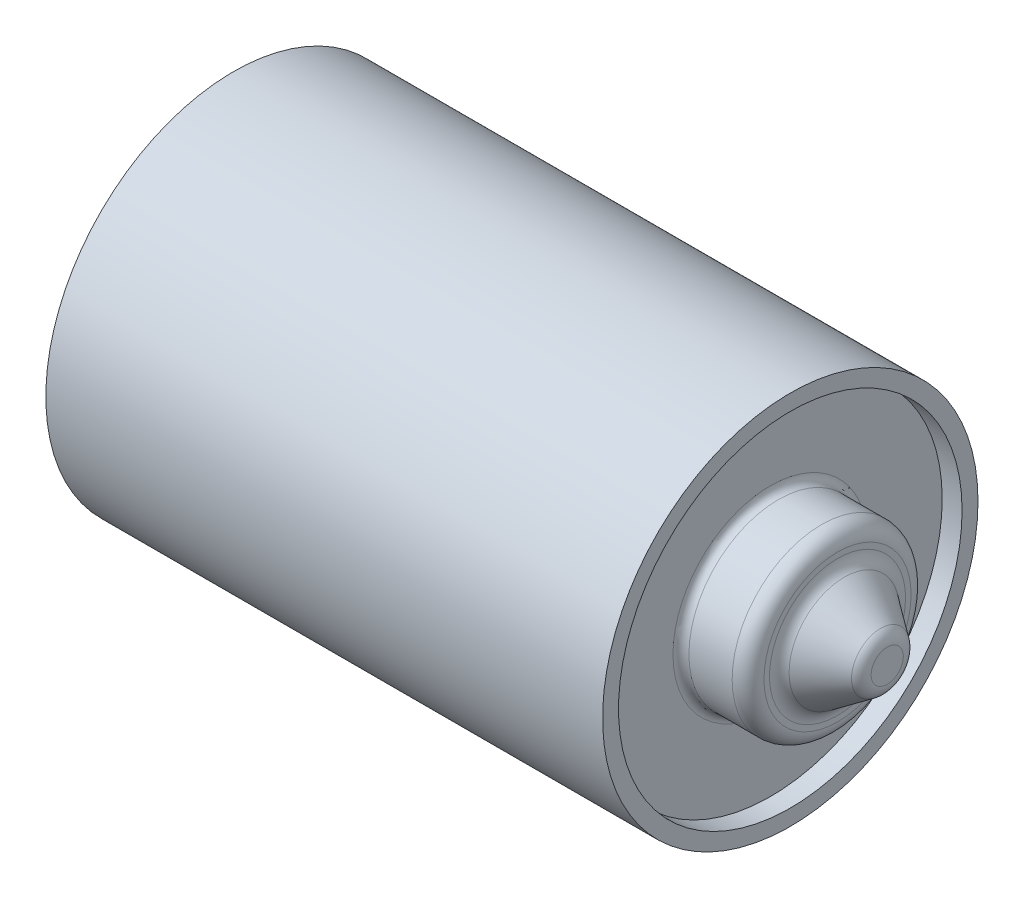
ISO-10303-21;
HEADER;
FILE_DESCRIPTION(('STEP AP214'),'2;1');
FILE_NAME('part.step','',(''),(''),'','','');
FILE_SCHEMA(('AUTOMOTIVE_DESIGN { 1 0 10303 214 1 1 1 1 }'));
ENDSEC;
DATA;
#1=APPLICATION_CONTEXT('core data for automotive mechanical design processes');
#2=APPLICATION_PROTOCOL_DEFINITION('international standard','automotive_design',2000,#1);
#3=PRODUCT_CONTEXT('',#1,'mechanical');
#4=PRODUCT('Part','Part','',(#3));
#5=PRODUCT_RELATED_PRODUCT_CATEGORY('part','',(#4));
#6=PRODUCT_DEFINITION_FORMATION('','',#4);
#7=PRODUCT_DEFINITION_CONTEXT('part definition',#1,'design');
#8=PRODUCT_DEFINITION('design','',#6,#7);
#9=PRODUCT_DEFINITION_SHAPE('','',#8);
#10=(LENGTH_UNIT() NAMED_UNIT(*) SI_UNIT(.MILLI.,.METRE.));
#11=(NAMED_UNIT(*) PLANE_ANGLE_UNIT() SI_UNIT($,.RADIAN.));
#12=(NAMED_UNIT(*) SI_UNIT($,.STERADIAN.) SOLID_ANGLE_UNIT());
#13=UNCERTAINTY_MEASURE_WITH_UNIT(LENGTH_MEASURE(1.E-05),#10,'distance_accuracy_value','');
#14=(GEOMETRIC_REPRESENTATION_CONTEXT(3) GLOBAL_UNCERTAINTY_ASSIGNED_CONTEXT((#13)) GLOBAL_UNIT_ASSIGNED_CONTEXT((#10,
#11,#12)) REPRESENTATION_CONTEXT('',''));
#15=CARTESIAN_POINT('',(0.,0.,0.));
#16=DIRECTION('',(0.,0.,1.));
#17=DIRECTION('',(1.,0.,0.));
#18=AXIS2_PLACEMENT_3D('',#15,#16,#17);
#19=CARTESIAN_POINT('',(774.926761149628,58.1044475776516,38.1099480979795));
#20=DIRECTION('',(1.,0.,0.));
#21=DIRECTION('',(0.,0.,-1.));
#22=AXIS2_PLACEMENT_3D('',#19,#20,#21);
#23=PLANE('',#22);
#24=CARTESIAN_POINT('',(774.926761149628,56.8205450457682,38.1099480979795));
#25=DIRECTION('',(-1.,0.,0.));
#26=DIRECTION('',(0.,0.,-1.));
#27=AXIS2_PLACEMENT_3D('',#24,#25,#26);
#28=CIRCLE('',#27,2.56780506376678);
#29=CARTESIAN_POINT('',(774.926761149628,56.8205450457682,35.5421430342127));
#30=VERTEX_POINT('',#29);
#31=CARTESIAN_POINT('',(774.926761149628,56.8205450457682,40.6777531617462));
#32=VERTEX_POINT('',#31);
#33=EDGE_CURVE('E68',#30,#32,#28,.T.);
#34=ORIENTED_EDGE('',*,*,#33,.F.);
#35=CARTESIAN_POINT('',(774.926761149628,56.8205450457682,38.1099480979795));
#36=DIRECTION('',(-1.,0.,0.));
#37=DIRECTION('',(0.,1.,0.));
#38=AXIS2_PLACEMENT_3D('',#35,#36,#37);
#39=CIRCLE('',#38,2.5678050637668);
#40=CARTESIAN_POINT('',(774.926761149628,59.388350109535,38.1099480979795));
#41=VERTEX_POINT('',#40);
#42=EDGE_CURVE('E72',#41,#30,#39,.T.);
#43=ORIENTED_EDGE('',*,*,#42,.F.);
#44=CARTESIAN_POINT('',(774.926761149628,56.8205450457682,38.1099480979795));
#45=DIRECTION('',(-1.,0.,0.));
#46=DIRECTION('',(0.,0.,1.));
#47=AXIS2_PLACEMENT_3D('',#44,#45,#46);
#48=CIRCLE('',#47,2.56780506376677);
#49=EDGE_CURVE('E74',#32,#41,#48,.T.);
#50=ORIENTED_EDGE('',*,*,#49,.F.);
#51=EDGE_LOOP('',(#34,#43,#50));
#52=FACE_BOUND('',#51,.T.);
#53=ADVANCED_FACE('F16',(#52),#23,.T.);
#54=CARTESIAN_POINT('',(772.386761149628,56.8205450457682,38.1099480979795));
#55=DIRECTION('',(1.,0.,0.));
#56=DIRECTION('',(0.,0.,-1.));
#57=AXIS2_PLACEMENT_3D('',#54,#55,#56);
#58=TOROIDAL_SURFACE('',#57,2.56780506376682,2.54);
#59=CARTESIAN_POINT('',(773.864951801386,56.8205450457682,38.1099480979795));
#60=DIRECTION('',(-1.,0.,0.));
#61=DIRECTION('',(0.,1.,0.));
#62=AXIS2_PLACEMENT_3D('',#59,#60,#61);
#63=CIRCLE('',#62,4.63336852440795);
#64=CARTESIAN_POINT('',(773.864951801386,61.4539135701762,38.1099480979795));
#65=VERTEX_POINT('',#64);
#66=EDGE_CURVE('E81',#65,#65,#63,.T.);
#67=ORIENTED_EDGE('',*,*,#66,.F.);
#68=EDGE_LOOP('',(#67));
#69=FACE_BOUND('',#68,.T.);
#70=ORIENTED_EDGE('',*,*,#49,.T.);
#71=ORIENTED_EDGE('',*,*,#42,.T.);
#72=ORIENTED_EDGE('',*,*,#33,.T.);
#73=EDGE_LOOP('',(#70,#71,#72));
#74=FACE_BOUND('',#73,.T.);
#75=ADVANCED_FACE('F79',(#69,#74),#58,.T.);
#76=CARTESIAN_POINT('',(768.051070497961,56.8205450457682,38.1099480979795));
#77=DIRECTION('',(-1.,0.,0.));
#78=DIRECTION('',(0.,0.,1.));
#79=AXIS2_PLACEMENT_3D('',#76,#77,#78);
#80=CONICAL_SURFACE('',#79,8.7939886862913,0.621142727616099);
#81=CARTESIAN_POINT('',(768.051070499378,56.8205450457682,38.1099480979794));
#82=DIRECTION('',(-1.,0.,0.));
#83=DIRECTION('',(0.,0.,1.));
#84=AXIS2_PLACEMENT_3D('',#81,#82,#83);
#85=CIRCLE('',#84,8.79398868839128);
#86=CARTESIAN_POINT('',(768.051070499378,56.8205450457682,46.9039367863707));
#87=VERTEX_POINT('',#86);
#88=EDGE_CURVE('E108',#87,#87,#85,.T.);
#89=ORIENTED_EDGE('',*,*,#88,.F.);
#90=EDGE_LOOP('',(#89));
#91=FACE_BOUND('',#90,.T.);
#92=ORIENTED_EDGE('',*,*,#66,.T.);
#93=EDGE_LOOP('',(#92));
#94=FACE_BOUND('',#93,.T.);
#95=ADVANCED_FACE('F99',(#91,#94),#80,.T.);
#96=CARTESIAN_POINT('',(769.529261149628,56.8205450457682,38.1099480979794));
#97=DIRECTION('',(1.,0.,0.));
#98=DIRECTION('',(0.,0.,-1.));
#99=AXIS2_PLACEMENT_3D('',#96,#97,#98);
#100=TOROIDAL_SURFACE('',#99,10.8595521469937,2.53999999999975);
#101=CARTESIAN_POINT('',(766.989261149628,56.8205450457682,38.1099480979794));
#102=DIRECTION('',(1.,0.,0.));
#103=DIRECTION('',(0.,0.,-1.));
#104=AXIS2_PLACEMENT_3D('',#101,#102,#103);
#105=CIRCLE('',#104,10.859552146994);
#106=CARTESIAN_POINT('',(766.989261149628,56.8205450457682,27.2503959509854));
#107=VERTEX_POINT('',#106);
#108=EDGE_CURVE('E121',#107,#107,#105,.F.);
#109=ORIENTED_EDGE('',*,*,#108,.F.);
#110=EDGE_LOOP('',(#109));
#111=FACE_BOUND('',#110,.T.);
#112=ORIENTED_EDGE('',*,*,#88,.T.);
#113=EDGE_LOOP('',(#112));
#114=FACE_BOUND('',#113,.T.);
#115=ADVANCED_FACE('F206',(#111,#114),#100,.F.);
#116=CARTESIAN_POINT('',(766.989261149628,68.1240711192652,38.1099480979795));
#117=DIRECTION('',(1.,0.,0.));
#118=DIRECTION('',(0.,0.,-1.));
#119=AXIS2_PLACEMENT_3D('',#116,#117,#118);
#120=PLANE('',#119);
#121=ORIENTED_EDGE('',*,*,#108,.T.);
#122=EDGE_LOOP('',(#121));
#123=FACE_BOUND('',#122,.T.);
#124=CARTESIAN_POINT('',(766.989261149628,56.8205450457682,38.1099480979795));
#125=DIRECTION('',(-1.,0.,0.));
#126=DIRECTION('',(0.,0.,-1.));
#127=AXIS2_PLACEMENT_3D('',#124,#125,#126);
#128=CIRCLE('',#127,11.7475000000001);
#129=CARTESIAN_POINT('',(766.989261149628,56.8205450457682,26.3624480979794));
#130=VERTEX_POINT('',#129);
#131=CARTESIAN_POINT('',(766.989261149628,56.8205450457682,49.8574480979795));
#132=VERTEX_POINT('',#131);
#133=EDGE_CURVE('E125',#130,#132,#128,.T.);
#134=ORIENTED_EDGE('',*,*,#133,.F.);
#135=CARTESIAN_POINT('',(766.989261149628,56.8205450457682,38.1099480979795));
#136=DIRECTION('',(-1.,0.,0.));
#137=DIRECTION('',(0.,1.,0.));
#138=AXIS2_PLACEMENT_3D('',#135,#136,#137);
#139=CIRCLE('',#138,11.7475000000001);
#140=CARTESIAN_POINT('',(766.989261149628,68.5680450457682,38.1099480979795));
#141=VERTEX_POINT('',#140);
#142=EDGE_CURVE('E52',#141,#130,#139,.T.);
#143=ORIENTED_EDGE('',*,*,#142,.F.);
#144=CARTESIAN_POINT('',(766.989261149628,56.8205450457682,38.1099480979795));
#145=DIRECTION('',(-1.,0.,0.));
#146=DIRECTION('',(0.,0.,1.));
#147=AXIS2_PLACEMENT_3D('',#144,#145,#146);
#148=CIRCLE('',#147,11.7475);
#149=EDGE_CURVE('E129',#132,#141,#148,.T.);
#150=ORIENTED_EDGE('',*,*,#149,.F.);
#151=EDGE_LOOP('',(#134,#143,#150));
#152=FACE_BOUND('',#151,.T.);
#153=ADVANCED_FACE('F149',(#123,#152),#120,.T.);
#154=CARTESIAN_POINT('',(764.449261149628,56.8205450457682,38.1099480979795));
#155=DIRECTION('',(1.,0.,0.));
#156=DIRECTION('',(0.,0.,-1.));
#157=AXIS2_PLACEMENT_3D('',#154,#155,#156);
#158=TOROIDAL_SURFACE('',#157,11.7475,2.54000000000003);
#159=CARTESIAN_POINT('',(764.449261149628,56.8205450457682,38.1099480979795));
#160=DIRECTION('',(1.,0.,0.));
#161=DIRECTION('',(0.,0.,-1.));
#162=AXIS2_PLACEMENT_3D('',#159,#160,#161);
#163=CIRCLE('',#162,14.2875);
#164=CARTESIAN_POINT('',(764.449261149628,56.8205450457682,23.8224480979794));
#165=VERTEX_POINT('',#164);
#166=EDGE_CURVE('E161',#165,#165,#163,.F.);
#167=ORIENTED_EDGE('',*,*,#166,.F.);
#168=EDGE_LOOP('',(#167));
#169=FACE_BOUND('',#168,.T.);
#170=ORIENTED_EDGE('',*,*,#149,.T.);
#171=ORIENTED_EDGE('',*,*,#142,.T.);
#172=ORIENTED_EDGE('',*,*,#133,.T.);
#173=EDGE_LOOP('',(#170,#171,#172));
#174=FACE_BOUND('',#173,.T.);
#175=ADVANCED_FACE('F138',(#169,#174),#158,.T.);
#176=CARTESIAN_POINT('',(760.996131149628,56.8205450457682,38.1099480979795));
#177=DIRECTION('',(1.,0.,0.));
#178=DIRECTION('',(0.,0.,-1.));
#179=AXIS2_PLACEMENT_3D('',#176,#177,#178);
#180=CYLINDRICAL_SURFACE('',#179,14.2875);
#181=CARTESIAN_POINT('',(757.543001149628,56.8205450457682,38.1099480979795));
#182=DIRECTION('',(-1.,0.,0.));
#183=DIRECTION('',(0.,0.,1.));
#184=AXIS2_PLACEMENT_3D('',#181,#182,#183);
#185=CIRCLE('',#184,14.2875);
#186=CARTESIAN_POINT('',(757.543001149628,56.8205450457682,52.3974480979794));
#187=VERTEX_POINT('',#186);
#188=EDGE_CURVE('E159',#187,#187,#185,.T.);
#189=ORIENTED_EDGE('',*,*,#188,.F.);
#190=EDGE_LOOP('',(#189));
#191=FACE_BOUND('',#190,.T.);
#192=ORIENTED_EDGE('',*,*,#166,.T.);
#193=EDGE_LOOP('',(#192));
#194=FACE_BOUND('',#193,.T.);
#195=ADVANCED_FACE('F148',(#191,#194),#180,.T.);
#196=CARTESIAN_POINT('',(757.543001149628,56.8205450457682,38.1099480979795));
#197=DIRECTION('',(1.,0.,0.));
#198=DIRECTION('',(0.,0.,-1.));
#199=AXIS2_PLACEMENT_3D('',#196,#197,#198);
#200=TOROIDAL_SURFACE('',#199,15.5575000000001,1.27000000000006);
#201=CARTESIAN_POINT('',(756.273001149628,56.8205450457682,53.6674480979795));
#202=CARTESIAN_POINT('',(756.273001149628,58.2481641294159,53.6673507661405));
#203=CARTESIAN_POINT('',(756.273001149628,59.6514352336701,53.4077213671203));
#204=CARTESIAN_POINT('',(756.273001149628,61.1393053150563,53.132439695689));
#205=CARTESIAN_POINT('',(756.273001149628,62.5471784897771,52.5751295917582));
#206=CARTESIAN_POINT('',(756.273001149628,64.013177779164,51.9948101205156));
#207=CARTESIAN_POINT('',(756.273001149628,65.3337607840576,51.1315057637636));
#208=CARTESIAN_POINT('',(756.273001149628,66.6817690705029,50.2502726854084));
#209=CARTESIAN_POINT('',(756.273001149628,67.8213587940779,49.1107618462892));
#210=CARTESIAN_POINT('',(756.273001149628,68.9601910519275,47.9720084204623));
#211=CARTESIAN_POINT('',(756.273001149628,69.8421027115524,46.6231638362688));
#212=CARTESIAN_POINT('',(756.273001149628,70.7049234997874,45.3035178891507));
#213=CARTESIAN_POINT('',(756.273001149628,71.285726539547,43.8365815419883));
#214=CARTESIAN_POINT('',(756.273001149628,71.8427452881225,42.429717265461));
#215=CARTESIAN_POINT('',(756.273001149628,72.1183183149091,40.9408382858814));
#216=CARTESIAN_POINT('',(756.273001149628,72.3779476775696,39.5381004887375));
#217=CARTESIAN_POINT('',(756.273001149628,72.3780450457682,38.1099480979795));
#218=B_SPLINE_CURVE_WITH_KNOTS('',2,(#201,#202,#203,#204,#205,#206,#207,#208,#209,#210,#211,
#212,#213,#214,#215,#216,#217),.UNSPECIFIED.,.F.,.F.,(3,2,2,2,2,2,2,2,3),(0.,0.125,0.25,0.375,
0.5,0.625,0.75,0.875,1.),.UNSPECIFIED.);
#219=CARTESIAN_POINT('',(756.273001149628,56.8205450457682,53.6674480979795));
#220=VERTEX_POINT('',#219);
#221=CARTESIAN_POINT('',(756.273001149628,72.3780450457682,38.1099480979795));
#222=VERTEX_POINT('',#221);
#223=EDGE_CURVE('E44',#220,#222,#218,.T.);
#224=ORIENTED_EDGE('',*,*,#223,.F.);
#225=CARTESIAN_POINT('',(756.273001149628,56.8205450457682,38.1099480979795));
#226=DIRECTION('',(1.,0.,0.));
#227=DIRECTION('',(0.,0.,-1.));
#228=AXIS2_PLACEMENT_3D('',#225,#226,#227);
#229=CIRCLE('',#228,15.5575);
#230=CARTESIAN_POINT('',(756.273001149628,56.8205450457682,22.5524480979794));
#231=VERTEX_POINT('',#230);
#232=EDGE_CURVE('E36',#231,#220,#229,.F.);
#233=ORIENTED_EDGE('',*,*,#232,.F.);
#234=CARTESIAN_POINT('',(756.273001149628,72.3780450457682,38.1099480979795));
#235=CARTESIAN_POINT('',(756.273001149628,72.3779477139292,36.6823290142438));
#236=CARTESIAN_POINT('',(756.273001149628,72.1183183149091,35.2790579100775));
#237=CARTESIAN_POINT('',(756.273001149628,71.8430366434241,33.7911878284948));
#238=CARTESIAN_POINT('',(756.273001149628,71.285726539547,32.3833146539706));
#239=CARTESIAN_POINT('',(756.273001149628,70.7054070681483,30.9173153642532));
#240=CARTESIAN_POINT('',(756.273001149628,69.8421027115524,29.5967323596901));
#241=CARTESIAN_POINT('',(756.273001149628,68.9608696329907,28.2487240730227));
#242=CARTESIAN_POINT('',(756.273001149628,67.8213587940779,27.1091343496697));
#243=CARTESIAN_POINT('',(756.273001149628,66.6826053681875,25.9703020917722));
#244=CARTESIAN_POINT('',(756.273001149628,65.3337607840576,25.0883904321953));
#245=CARTESIAN_POINT('',(756.273001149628,64.0141148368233,24.2255696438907));
#246=CARTESIAN_POINT('',(756.273001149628,62.547178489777,23.6447666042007));
#247=CARTESIAN_POINT('',(756.273001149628,61.1403142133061,23.0877478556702));
#248=CARTESIAN_POINT('',(756.273001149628,59.6514352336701,22.8121748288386));
#249=CARTESIAN_POINT('',(756.273001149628,58.2486974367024,22.5525454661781));
#250=CARTESIAN_POINT('',(756.273001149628,56.8205450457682,22.5524480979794));
#251=B_SPLINE_CURVE_WITH_KNOTS('',2,(#234,#235,#236,#237,#238,#239,#240,#241,#242,#243,#244,
#245,#246,#247,#248,#249,#250),.UNSPECIFIED.,.F.,.F.,(3,2,2,2,2,2,2,2,3),(0.,0.125,0.25,0.375,
0.5,0.625,0.75,0.875,1.),.UNSPECIFIED.);
#252=EDGE_CURVE('E237',#222,#231,#251,.T.);
#253=ORIENTED_EDGE('',*,*,#252,.F.);
#254=EDGE_LOOP('',(#224,#233,#253));
#255=FACE_BOUND('',#254,.T.);
#256=ORIENTED_EDGE('',*,*,#188,.T.);
#257=EDGE_LOOP('',(#256));
#258=FACE_BOUND('',#257,.T.);
#259=ADVANCED_FACE('F18',(#255,#258),#200,.F.);
#260=CARTESIAN_POINT('',(756.273001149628,78.3152950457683,38.1099480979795));
#261=DIRECTION('',(1.,0.,0.));
#262=DIRECTION('',(0.,0.,-1.));
#263=AXIS2_PLACEMENT_3D('',#260,#261,#262);
#264=PLANE('',#263);
#265=ORIENTED_EDGE('',*,*,#252,.T.);
#266=ORIENTED_EDGE('',*,*,#232,.T.);
#267=ORIENTED_EDGE('',*,*,#223,.T.);
#268=EDGE_LOOP('',(#265,#266,#267));
#269=FACE_BOUND('',#268,.T.);
#270=CARTESIAN_POINT('',(756.273001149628,56.8205450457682,38.1099480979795));
#271=DIRECTION('',(1.,0.,0.));
#272=DIRECTION('',(0.,0.,-1.));
#273=AXIS2_PLACEMENT_3D('',#270,#271,#272);
#274=CIRCLE('',#273,27.432);
#275=CARTESIAN_POINT('',(756.273001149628,56.8205450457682,10.6779480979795));
#276=VERTEX_POINT('',#275);
#277=EDGE_CURVE('E338',#276,#276,#274,.T.);
#278=ORIENTED_EDGE('',*,*,#277,.T.);
#279=EDGE_LOOP('',(#278));
#280=FACE_BOUND('',#279,.T.);
#281=ADVANCED_FACE('F231',(#269,#280),#264,.T.);
#282=CARTESIAN_POINT('',(757.860501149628,56.8205450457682,38.1099480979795));
#283=DIRECTION('',(1.,0.,0.));
#284=DIRECTION('',(0.,0.,-1.));
#285=AXIS2_PLACEMENT_3D('',#282,#283,#284);
#286=CYLINDRICAL_SURFACE('',#285,27.432);
#287=ORIENTED_EDGE('',*,*,#277,.F.);
#288=EDGE_LOOP('',(#287));
#289=FACE_BOUND('',#288,.T.);
#290=CARTESIAN_POINT('',(759.448001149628,56.8205450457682,38.1099480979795));
#291=DIRECTION('',(1.,0.,0.));
#292=DIRECTION('',(0.,0.,-1.));
#293=AXIS2_PLACEMENT_3D('',#290,#291,#292);
#294=CIRCLE('',#293,27.432);
#295=CARTESIAN_POINT('',(759.448001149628,56.8205450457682,10.6779480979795));
#296=VERTEX_POINT('',#295);
#297=EDGE_CURVE('E340',#296,#296,#294,.F.);
#298=ORIENTED_EDGE('',*,*,#297,.F.);
#299=EDGE_LOOP('',(#298));
#300=FACE_BOUND('',#299,.T.);
#301=ADVANCED_FACE('F228',(#289,#300),#286,.F.);
#302=CARTESIAN_POINT('',(670.548001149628,71.8065450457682,38.1099480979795));
#303=DIRECTION('',(-1.,0.,0.));
#304=DIRECTION('',(0.,0.,1.));
#305=AXIS2_PLACEMENT_3D('',#302,#303,#304);
#306=PLANE('',#305);
#307=CARTESIAN_POINT('',(670.548001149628,56.8205450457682,38.1099480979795));
#308=DIRECTION('',(1.,0.,0.));
#309=DIRECTION('',(0.,0.,-1.));
#310=AXIS2_PLACEMENT_3D('',#307,#308,#309);
#311=CIRCLE('',#310,29.972);
#312=CARTESIAN_POINT('',(670.548001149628,56.8205450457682,8.13794809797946));
#313=VERTEX_POINT('',#312);
#314=EDGE_CURVE('E28',#313,#313,#311,.T.);
#315=ORIENTED_EDGE('',*,*,#314,.F.);
#316=EDGE_LOOP('',(#315));
#317=FACE_BOUND('',#316,.T.);
#318=ADVANCED_FACE('F220',(#317),#306,.T.);
#319=CARTESIAN_POINT('',(759.448001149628,85.5225450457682,38.1099480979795));
#320=DIRECTION('',(1.,0.,0.));
#321=DIRECTION('',(0.,0.,-1.));
#322=AXIS2_PLACEMENT_3D('',#319,#320,#321);
#323=PLANE('',#322);
#324=ORIENTED_EDGE('',*,*,#297,.T.);
#325=EDGE_LOOP('',(#324));
#326=FACE_BOUND('',#325,.T.);
#327=CARTESIAN_POINT('',(759.448001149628,56.8205450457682,38.1099480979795));
#328=DIRECTION('',(1.,0.,0.));
#329=DIRECTION('',(0.,0.,-1.));
#330=AXIS2_PLACEMENT_3D('',#327,#328,#329);
#331=CIRCLE('',#330,29.972);
#332=CARTESIAN_POINT('',(759.448001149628,56.8205450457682,8.13794809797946));
#333=VERTEX_POINT('',#332);
#334=EDGE_CURVE('E11',#333,#333,#331,.F.);
#335=ORIENTED_EDGE('',*,*,#334,.F.);
#336=EDGE_LOOP('',(#335));
#337=FACE_BOUND('',#336,.T.);
#338=ADVANCED_FACE('F214',(#326,#337),#323,.T.);
#339=CARTESIAN_POINT('',(714.998001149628,56.8205450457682,38.1099480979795));
#340=DIRECTION('',(1.,0.,0.));
#341=DIRECTION('',(0.,0.,-1.));
#342=AXIS2_PLACEMENT_3D('',#339,#340,#341);
#343=CYLINDRICAL_SURFACE('',#342,29.972);
#344=ORIENTED_EDGE('',*,*,#314,.T.);
#345=EDGE_LOOP('',(#344));
#346=FACE_BOUND('',#345,.T.);
#347=ORIENTED_EDGE('',*,*,#334,.T.);
#348=EDGE_LOOP('',(#347));
#349=FACE_BOUND('',#348,.T.);
#350=ADVANCED_FACE('F212',(#346,#349),#343,.T.);
#351=CLOSED_SHELL('',(#53,#75,#95,#115,#153,#175,#195,#259,#281,#301,#318,#338,#350));
#352=MANIFOLD_SOLID_BREP('B1',#351);
#353=ADVANCED_BREP_SHAPE_REPRESENTATION('',(#18,#352),#14);
#354=SHAPE_DEFINITION_REPRESENTATION(#9,#353);
ENDSEC;
END-ISO-10303-21;
